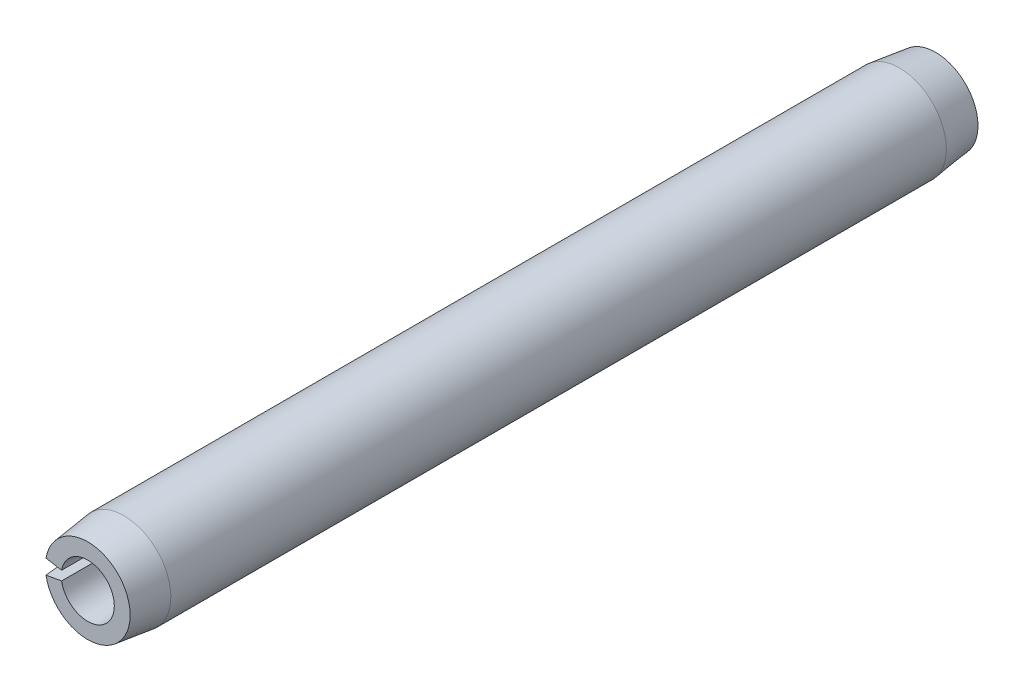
from build123d import *

# Parameters (mm, degrees)
EXTRUDE1_DEPTH      = 9.525
EXTRUDE1_DEPTH_BACK = 9.525


with BuildPart() as part:
    # Sketch1 → Extrude1 (new, two sides: drawn at the far end of the back side and taken through both)
    with BuildSketch(Plane.XY.offset(-EXTRUDE1_DEPTH_BACK)):
        with BuildLine():
            Line((-0.587831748, -0.103650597), (-1.038085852, -0.183042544))
            ThreePointArc((-1.038085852, -0.183042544), (1.0541, 0), (-1.038085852, 0.183042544))
            Line((-1.038085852, 0.183042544), (-0.587831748, 0.103650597))
            ThreePointArc((-0.587831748, 0.103650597), (0.5969, 0), (-0.587831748, -0.103650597))
        make_face()
    extrude(amount=EXTRUDE1_DEPTH + EXTRUDE1_DEPTH_BACK)

    # Sketch2 → Cut-Revolve1 (revolve, cut)
    with BuildSketch(Plane(origin=(0, 0, 0), x_dir=(0, 0, -1), z_dir=(1, 0, 0))):
        Polygon((9.525, 0.9525), (8.7122, 1.0541), (9.525, 1.0541), align=None)
    cut_revolve1 = revolve(axis=Axis((0, 0, -9.525), (0, 0, 1)), mode=Mode.SUBTRACT)

    # Mirror1: Cut-Revolve1 across plane
    add(cut_revolve1.mirror(Plane.XY), mode=Mode.SUBTRACT)


solid = part.part
